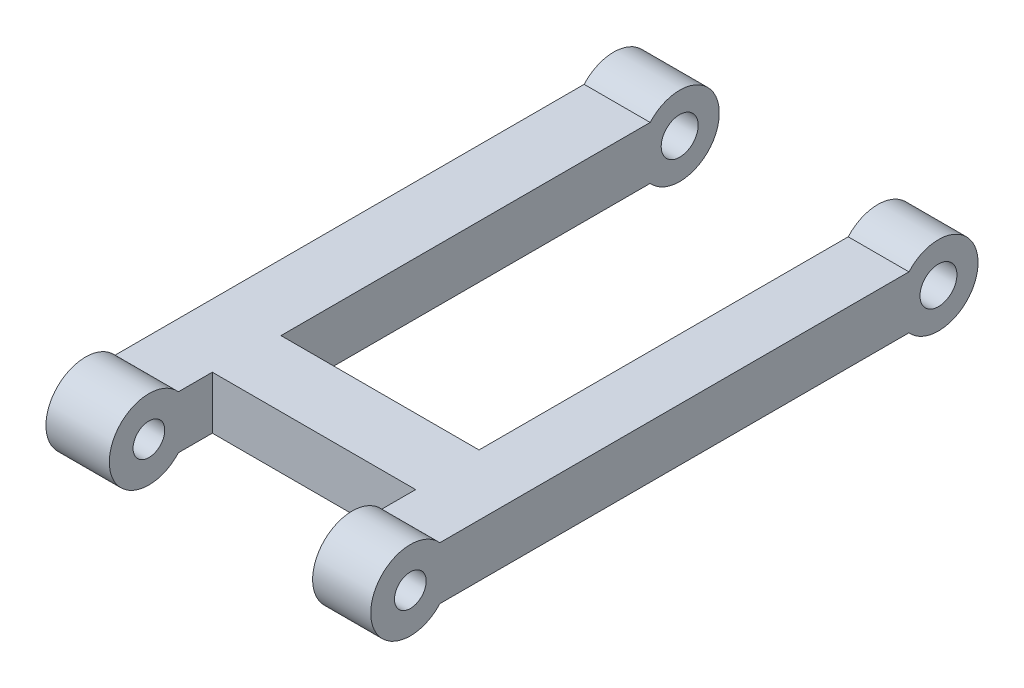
from build123d import *

# Parameters (mm, degrees)
SKETCH1_W               = 50.8
SKETCH1_H               = 5.08
BOSS_EXTRUDE1_DEPTH     = 31.242
SKETCH2_R               = 3.81
BOSS_EXTRUDE2_DEPTH     = 31.242
CUT_EXTRUDE1_DEPTH      = 64.234778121
CUT_EXTRUDE1_DEPTH_BACK = 64.234778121
SKETCH3_W               = 19.558
SKETCH3_H               = 13.661235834
SKETCH4_R               = 1.778
SKETCH4_R_2             = 1.524
CUT_EXTRUDE2_DEPTH      = 64.234778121


with BuildPart() as part:
    # Sketch1 → Boss-Extrude1 (new body)
    with BuildSketch(Plane(origin=(0, 0, 0), x_dir=(0, 0, -1), z_dir=(1, 0, 0))):
        with Locations((25.4, 2.54)):
            Rectangle(SKETCH1_W, SKETCH1_H)
    extrude(amount=BOSS_EXTRUDE1_DEPTH)

    # Sketch2 → Boss-Extrude2 (add)
    with BuildSketch(Plane(origin=(31.242, 0, 0), x_dir=(0, 0, -1), z_dir=(1, 0, 0))):
        with Locations((0, 2.54)):
            Circle(SKETCH2_R)
        with Locations((50.8, 2.54)):
            Circle(SKETCH2_R)
    extrude(amount=-BOSS_EXTRUDE2_DEPTH)

    # Sketch3 → Cut-Extrude1 (cut, two sides: drawn at the far end of the back side and taken through both)
    with BuildSketch(Plane(origin=(0, 5.08, 0), x_dir=(1, 0, 0), z_dir=(0, 1, 0)).offset(-CUT_EXTRUDE1_DEPTH_BACK)):
        Polygon((6.35, 57.910070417), (6.35, 26.527465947), (6.35, 12.449436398), (25.4, 12.449436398), (25.4, 26.527465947), (25.4, 57.910070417), align=None)
        with Locations((15.875, -0.731181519)):
            Rectangle(SKETCH3_W, SKETCH3_H)
    extrude(amount=CUT_EXTRUDE1_DEPTH + CUT_EXTRUDE1_DEPTH_BACK, mode=Mode.SUBTRACT)

    # Sketch4 → Cut-Extrude2 (cut, through all)
    with BuildSketch(Plane.ZY):
        with Locations((-50.8, 2.54)):
            Circle(SKETCH4_R)
        with Locations((0, 2.54)):
            Circle(SKETCH4_R_2)
    extrude(amount=-CUT_EXTRUDE2_DEPTH, mode=Mode.SUBTRACT)


solid = part.part
